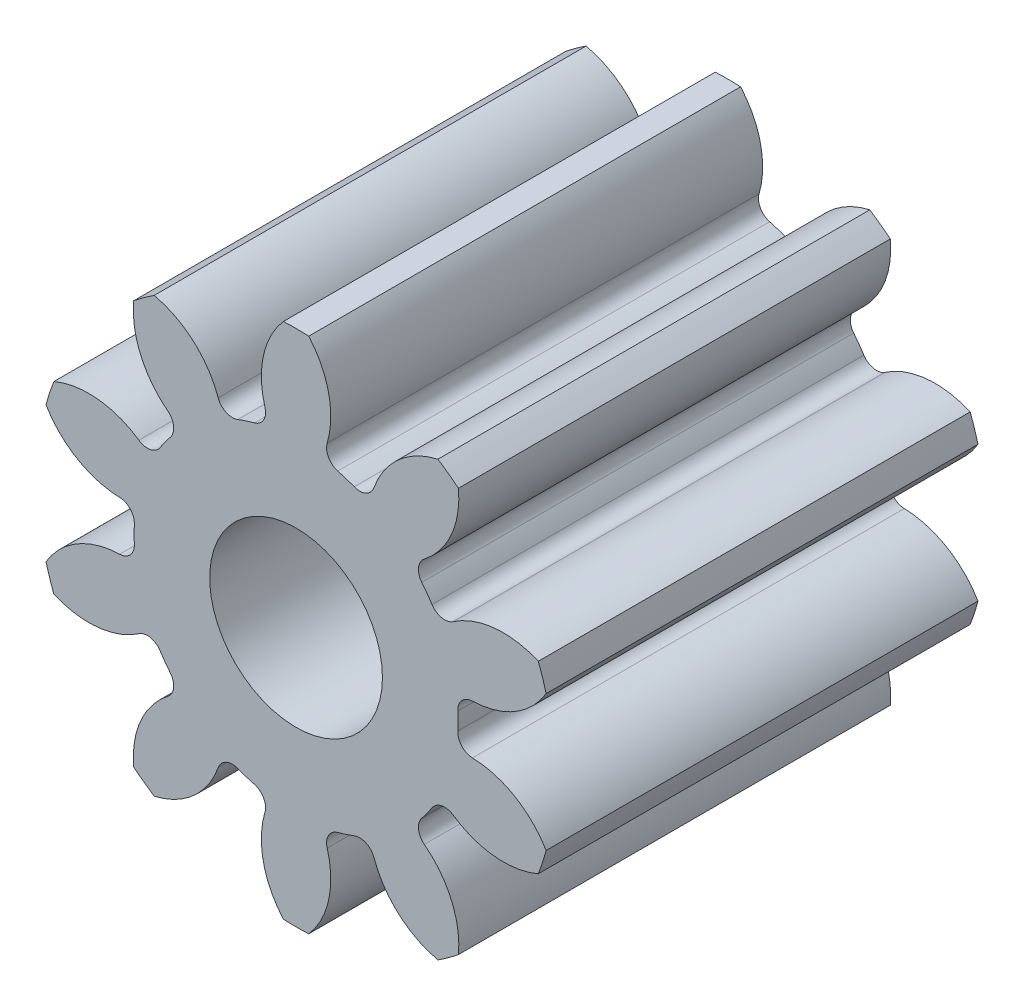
from build123d import *

# Parameters (mm, degrees)
BOSS_EXTRU_1_DEPTH                 = 5
CONG_1_R                           = 0.175
R_P_TITION_CIRCULAIRE4_COUNT       = 10
CONG_1_OF_R_P_TITION_CIRCULAIRE4_R = 0.175
ESQUISSE10_R                       = 1
ENL_V_MAT_EXTRU_4_DEPTH            = 8.479426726


with BuildPart() as part:
    # Esquisse3 → Boss.-Extru.1 (new body)
    with BuildSketch(Plane.XY):
        with BuildLine():
            Line((-1.958113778, 1.222878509), (-1.378706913, -0.560352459))
            Line((-1.378706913, -0.560352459), (-0.799300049, 1.222878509))
            ThreePointArc((-0.799300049, 1.222878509), (-0.942925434, 1.263303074), (-1.089310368, 1.292179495))
            ThreePointArc((-1.089310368, 1.292179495), (-0.984517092, 1.886051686), (-1.231837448, 2.436050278))
            ThreePointArc((-1.231837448, 2.436050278), (-1.378706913, 2.439647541), (-1.525576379, 2.436050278))
            ThreePointArc((-1.525576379, 2.436050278), (-1.772896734, 1.886051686), (-1.668103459, 1.292179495))
            ThreePointArc((-1.668103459, 1.292179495), (-1.814488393, 1.263303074), (-1.958113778, 1.222878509))
        make_face()
    boss_extru_1 = extrude(amount=BOSS_EXTRU_1_DEPTH)

    # Cong_1
    cong_1_edges = [part.edges().sort_by_distance(p)[0] for p in [
        (-1.668103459, 1.292179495, 2.5),
        (-1.089310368, 1.292179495, 2.5),
    ]]
    fillet(cong_1_edges, radius=CONG_1_R)

    # R_p_tition circulaire4: Boss.-Extru.1 ×10 about axis
    r_p_tition_circulaire4_axis = Axis((-1.378706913, -0.560352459, 0), (0, 0, 1))
    for i in range(1, R_P_TITION_CIRCULAIRE4_COUNT):
        add(boss_extru_1.rotate(r_p_tition_circulaire4_axis, i * 360 / R_P_TITION_CIRCULAIRE4_COUNT))

    # Cong_1 of R_p_tition circulaire4
    cong_1_of_r_p_tition_circulaire4_edges = [part.edges().sort_by_distance(p)[0] for p in [
        (-2.701724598, 0.768274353, 2.5),
        (-2.233471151, 1.108480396, 2.5),
        (-3.22999795, -0.263121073, 2.5),
        (-3.051141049, 0.287343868, 2.5),
        (-3.051141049, -1.408048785, 2.5),
        (-3.22999795, -0.857583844, 2.5),
        (-2.233471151, -2.229185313, 2.5),
        (-2.701724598, -1.88897927, 2.5),
        (-1.089310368, -2.412884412, 2.5),
        (-1.668103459, -2.412884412, 2.5),
        (-0.055689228, -1.88897927, 2.5),
        (-0.523942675, -2.229185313, 2.5),
        (0.472584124, -0.857583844, 2.5),
        (0.293727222, -1.408048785, 2.5),
        (0.293727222, 0.287343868, 2.5),
        (0.472584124, -0.263121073, 2.5),
        (-0.523942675, 1.108480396, 2.5),
        (-0.055689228, 0.768274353, 2.5),
    ]]
    fillet(cong_1_of_r_p_tition_circulaire4_edges, radius=CONG_1_OF_R_P_TITION_CIRCULAIRE4_R)

    # Esquisse10 → Enl_v. mat.-Extru.4 (cut, through all)
    with BuildSketch(Plane.XY):
        with Locations((-1.378706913, -0.560352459)):
            Circle(ESQUISSE10_R)
    extrude(amount=ENL_V_MAT_EXTRU_4_DEPTH, mode=Mode.SUBTRACT)


solid = part.part
